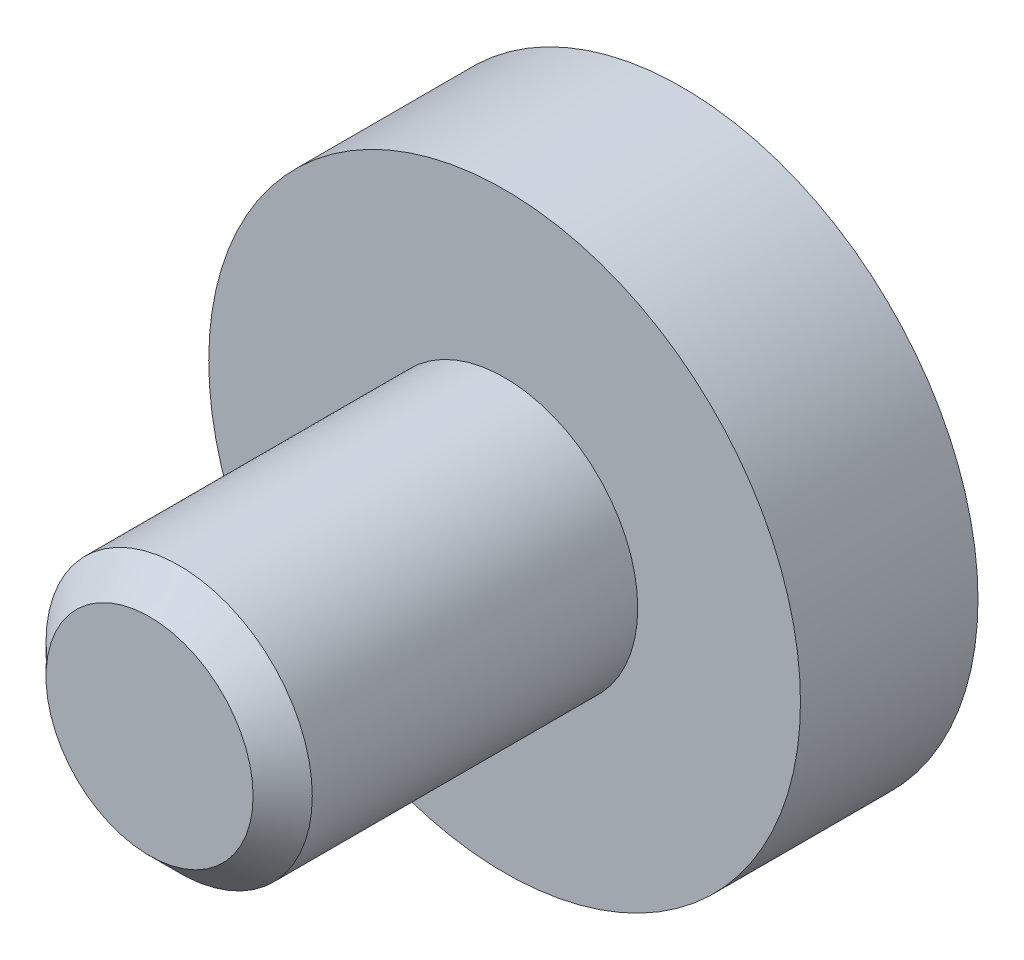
ISO-10303-21;
HEADER;
FILE_DESCRIPTION(('STEP AP214'),'2;1');
FILE_NAME('part.step','',(''),(''),'','','');
FILE_SCHEMA(('AUTOMOTIVE_DESIGN { 1 0 10303 214 1 1 1 1 }'));
ENDSEC;
DATA;
#1=APPLICATION_CONTEXT('core data for automotive mechanical design processes');
#2=APPLICATION_PROTOCOL_DEFINITION('international standard','automotive_design',2000,#1);
#3=PRODUCT_CONTEXT('',#1,'mechanical');
#4=PRODUCT('Part','Part','',(#3));
#5=PRODUCT_RELATED_PRODUCT_CATEGORY('part','',(#4));
#6=PRODUCT_DEFINITION_FORMATION('','',#4);
#7=PRODUCT_DEFINITION_CONTEXT('part definition',#1,'design');
#8=PRODUCT_DEFINITION('design','',#6,#7);
#9=PRODUCT_DEFINITION_SHAPE('','',#8);
#10=(LENGTH_UNIT() NAMED_UNIT(*) SI_UNIT(.MILLI.,.METRE.));
#11=(NAMED_UNIT(*) PLANE_ANGLE_UNIT() SI_UNIT($,.RADIAN.));
#12=(NAMED_UNIT(*) SI_UNIT($,.STERADIAN.) SOLID_ANGLE_UNIT());
#13=UNCERTAINTY_MEASURE_WITH_UNIT(LENGTH_MEASURE(1.E-05),#10,'distance_accuracy_value','');
#14=(GEOMETRIC_REPRESENTATION_CONTEXT(3) GLOBAL_UNCERTAINTY_ASSIGNED_CONTEXT((#13)) GLOBAL_UNIT_ASSIGNED_CONTEXT((#10,
#11,#12)) REPRESENTATION_CONTEXT('',''));
#15=CARTESIAN_POINT('',(0.,0.,0.));
#16=DIRECTION('',(0.,0.,1.));
#17=DIRECTION('',(1.,0.,0.));
#18=AXIS2_PLACEMENT_3D('',#15,#16,#17);
#19=CARTESIAN_POINT('',(0.,0.,3.));
#20=DIRECTION('',(0.,0.,-1.));
#21=DIRECTION('',(-1.,0.,0.));
#22=AXIS2_PLACEMENT_3D('',#19,#20,#21);
#23=CYLINDRICAL_SURFACE('',#22,5.);
#24=CARTESIAN_POINT('',(0.,0.,3.));
#25=DIRECTION('',(0.,0.,1.));
#26=DIRECTION('',(1.,0.,0.));
#27=AXIS2_PLACEMENT_3D('',#24,#25,#26);
#28=CIRCLE('',#27,5.);
#29=CARTESIAN_POINT('',(5.,0.,3.));
#30=VERTEX_POINT('',#29);
#31=EDGE_CURVE('E53',#30,#30,#28,.T.);
#32=ORIENTED_EDGE('',*,*,#31,.F.);
#33=EDGE_LOOP('',(#32));
#34=FACE_BOUND('',#33,.T.);
#35=CARTESIAN_POINT('',(0.,0.,0.));
#36=DIRECTION('',(0.,0.,1.));
#37=DIRECTION('',(1.,0.,0.));
#38=AXIS2_PLACEMENT_3D('',#35,#36,#37);
#39=CIRCLE('',#38,5.);
#40=CARTESIAN_POINT('',(5.,0.,0.));
#41=VERTEX_POINT('',#40);
#42=EDGE_CURVE('E56',#41,#41,#39,.T.);
#43=ORIENTED_EDGE('',*,*,#42,.T.);
#44=EDGE_LOOP('',(#43));
#45=FACE_BOUND('',#44,.T.);
#46=ADVANCED_FACE('F37',(#34,#45),#23,.T.);
#47=CARTESIAN_POINT('',(0.,0.,3.));
#48=DIRECTION('',(0.,0.,1.));
#49=DIRECTION('',(1.,0.,0.));
#50=AXIS2_PLACEMENT_3D('',#47,#48,#49);
#51=PLANE('',#50);
#52=CARTESIAN_POINT('',(0.,0.,3.));
#53=DIRECTION('',(0.,0.,1.));
#54=DIRECTION('',(1.,0.,0.));
#55=AXIS2_PLACEMENT_3D('',#52,#53,#54);
#56=CIRCLE('',#55,2.25);
#57=CARTESIAN_POINT('',(2.25,0.,3.));
#58=VERTEX_POINT('',#57);
#59=EDGE_CURVE('E49',#58,#58,#56,.T.);
#60=ORIENTED_EDGE('',*,*,#59,.F.);
#61=EDGE_LOOP('',(#60));
#62=FACE_BOUND('',#61,.T.);
#63=ORIENTED_EDGE('',*,*,#31,.T.);
#64=EDGE_LOOP('',(#63));
#65=FACE_BOUND('',#64,.T.);
#66=ADVANCED_FACE('F62',(#62,#65),#51,.T.);
#67=CARTESIAN_POINT('',(0.,0.,0.));
#68=DIRECTION('',(0.,0.,1.));
#69=DIRECTION('',(1.,0.,0.));
#70=AXIS2_PLACEMENT_3D('',#67,#68,#69);
#71=PLANE('',#70);
#72=ORIENTED_EDGE('',*,*,#42,.F.);
#73=EDGE_LOOP('',(#72));
#74=FACE_BOUND('',#73,.T.);
#75=ADVANCED_FACE('F68',(#74),#71,.F.);
#76=CARTESIAN_POINT('',(0.,0.,9.));
#77=DIRECTION('',(0.,0.,-1.));
#78=DIRECTION('',(-1.,0.,0.));
#79=AXIS2_PLACEMENT_3D('',#76,#77,#78);
#80=CYLINDRICAL_SURFACE('',#79,2.25);
#81=CARTESIAN_POINT('',(0.,0.,8.5));
#82=DIRECTION('',(0.,0.,1.));
#83=DIRECTION('',(1.,0.,0.));
#84=AXIS2_PLACEMENT_3D('',#81,#82,#83);
#85=CIRCLE('',#84,2.25);
#86=CARTESIAN_POINT('',(2.25,0.,8.5));
#87=VERTEX_POINT('',#86);
#88=EDGE_CURVE('E10',#87,#87,#85,.F.);
#89=ORIENTED_EDGE('',*,*,#88,.T.);
#90=EDGE_LOOP('',(#89));
#91=FACE_BOUND('',#90,.T.);
#92=ORIENTED_EDGE('',*,*,#59,.T.);
#93=EDGE_LOOP('',(#92));
#94=FACE_BOUND('',#93,.T.);
#95=ADVANCED_FACE('F70',(#91,#94),#80,.T.);
#96=CARTESIAN_POINT('',(0.,0.,9.));
#97=DIRECTION('',(0.,0.,1.));
#98=DIRECTION('',(1.,0.,0.));
#99=AXIS2_PLACEMENT_3D('',#96,#97,#98);
#100=PLANE('',#99);
#101=CARTESIAN_POINT('',(0.,0.,9.));
#102=DIRECTION('',(0.,0.,1.));
#103=DIRECTION('',(1.,0.,0.));
#104=AXIS2_PLACEMENT_3D('',#101,#102,#103);
#105=CIRCLE('',#104,1.75);
#106=CARTESIAN_POINT('',(1.75,0.,9.));
#107=VERTEX_POINT('',#106);
#108=EDGE_CURVE('E45',#107,#107,#105,.T.);
#109=ORIENTED_EDGE('',*,*,#108,.T.);
#110=EDGE_LOOP('',(#109));
#111=FACE_BOUND('',#110,.T.);
#112=ADVANCED_FACE('F76',(#111),#100,.T.);
#113=CARTESIAN_POINT('',(0.,0.,9.));
#114=DIRECTION('',(0.,0.,-1.));
#115=DIRECTION('',(-1.,0.,0.));
#116=AXIS2_PLACEMENT_3D('',#113,#114,#115);
#117=CONICAL_SURFACE('',#116,1.75,0.785398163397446);
#118=ORIENTED_EDGE('',*,*,#88,.F.);
#119=EDGE_LOOP('',(#118));
#120=FACE_BOUND('',#119,.T.);
#121=ORIENTED_EDGE('',*,*,#108,.F.);
#122=EDGE_LOOP('',(#121));
#123=FACE_BOUND('',#122,.T.);
#124=ADVANCED_FACE('F40',(#120,#123),#117,.T.);
#125=CLOSED_SHELL('',(#46,#66,#75,#95,#112,#124));
#126=MANIFOLD_SOLID_BREP('B2',#125);
#127=ADVANCED_BREP_SHAPE_REPRESENTATION('',(#18,#126),#14);
#128=SHAPE_DEFINITION_REPRESENTATION(#9,#127);
ENDSEC;
END-ISO-10303-21;
